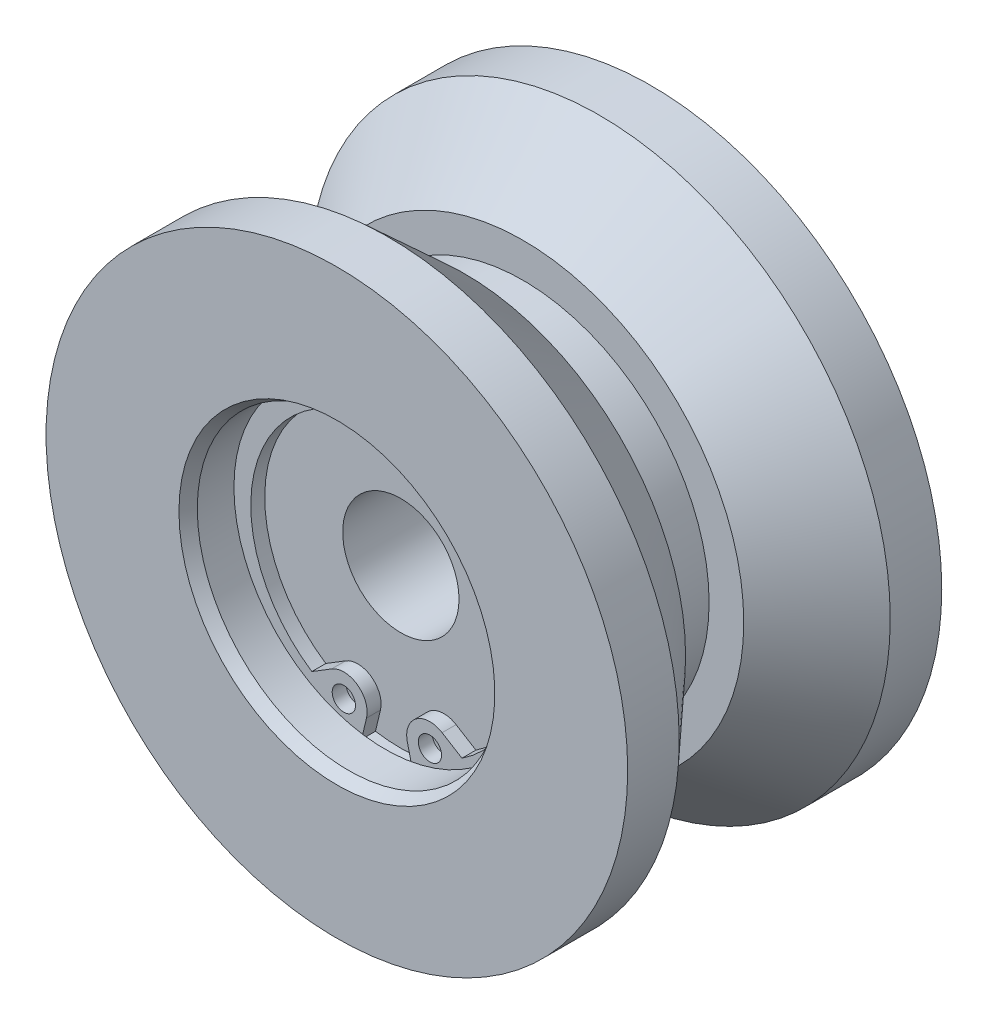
ISO-10303-21;
HEADER;
FILE_DESCRIPTION(('STEP AP214'),'2;1');
FILE_NAME('part.step','',(''),(''),'','','');
FILE_SCHEMA(('AUTOMOTIVE_DESIGN { 1 0 10303 214 1 1 1 1 }'));
ENDSEC;
DATA;
#1=APPLICATION_CONTEXT('core data for automotive mechanical design processes');
#2=APPLICATION_PROTOCOL_DEFINITION('international standard','automotive_design',2000,#1);
#3=PRODUCT_CONTEXT('',#1,'mechanical');
#4=PRODUCT('Part','Part','',(#3));
#5=PRODUCT_RELATED_PRODUCT_CATEGORY('part','',(#4));
#6=PRODUCT_DEFINITION_FORMATION('','',#4);
#7=PRODUCT_DEFINITION_CONTEXT('part definition',#1,'design');
#8=PRODUCT_DEFINITION('design','',#6,#7);
#9=PRODUCT_DEFINITION_SHAPE('','',#8);
#10=(LENGTH_UNIT() NAMED_UNIT(*) SI_UNIT(.MILLI.,.METRE.));
#11=(NAMED_UNIT(*) PLANE_ANGLE_UNIT() SI_UNIT($,.RADIAN.));
#12=(NAMED_UNIT(*) SI_UNIT($,.STERADIAN.) SOLID_ANGLE_UNIT());
#13=UNCERTAINTY_MEASURE_WITH_UNIT(LENGTH_MEASURE(1.E-05),#10,'distance_accuracy_value','');
#14=(GEOMETRIC_REPRESENTATION_CONTEXT(3) GLOBAL_UNCERTAINTY_ASSIGNED_CONTEXT((#13)) GLOBAL_UNIT_ASSIGNED_CONTEXT((#10,
#11,#12)) REPRESENTATION_CONTEXT('',''));
#15=CARTESIAN_POINT('',(0.,0.,0.));
#16=DIRECTION('',(0.,0.,1.));
#17=DIRECTION('',(1.,0.,0.));
#18=AXIS2_PLACEMENT_3D('',#15,#16,#17);
#19=CARTESIAN_POINT('',(0.,13.,7.9999999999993));
#20=DIRECTION('',(0.,0.,-1.));
#21=DIRECTION('',(-1.,0.,0.));
#22=AXIS2_PLACEMENT_3D('',#19,#20,#21);
#23=PLANE('',#22);
#24=CARTESIAN_POINT('',(3.7,-11.165302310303,7.9999999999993));
#25=DIRECTION('',(0.,0.,1.));
#26=DIRECTION('',(1.,0.,0.));
#27=AXIS2_PLACEMENT_3D('',#24,#25,#26);
#28=CIRCLE('',#27,1.);
#29=CARTESIAN_POINT('',(4.7,-11.165302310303,7.9999999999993));
#30=VERTEX_POINT('',#29);
#31=EDGE_CURVE('E117',#30,#30,#28,.T.);
#32=ORIENTED_EDGE('',*,*,#31,.T.);
#33=EDGE_LOOP('',(#32));
#34=FACE_BOUND('',#33,.T.);
#35=ADVANCED_FACE('F14',(#34),#23,.F.);
#36=CARTESIAN_POINT('',(-3.7,-11.165302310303,7.9999999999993));
#37=DIRECTION('',(0.,0.,-1.));
#38=DIRECTION('',(1.,0.,0.));
#39=AXIS2_PLACEMENT_3D('',#36,#37,#38);
#40=CIRCLE('',#39,1.);
#41=CARTESIAN_POINT('',(-2.7,-11.165302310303,7.9999999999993));
#42=VERTEX_POINT('',#41);
#43=EDGE_CURVE('E142',#42,#42,#40,.T.);
#44=ORIENTED_EDGE('',*,*,#43,.F.);
#45=EDGE_LOOP('',(#44));
#46=FACE_BOUND('',#45,.T.);
#47=ADVANCED_FACE('F247',(#46),#23,.F.);
#48=CARTESIAN_POINT('',(0.,0.,18.4999999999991));
#49=DIRECTION('',(0.,0.,1.));
#50=DIRECTION('',(1.,0.,0.));
#51=AXIS2_PLACEMENT_3D('',#48,#49,#50);
#52=CYLINDRICAL_SURFACE('',#51,16.);
#53=CARTESIAN_POINT('',(0.,0.,2.5));
#54=DIRECTION('',(0.,0.,1.));
#55=DIRECTION('',(1.,0.,0.));
#56=AXIS2_PLACEMENT_3D('',#53,#54,#55);
#57=CIRCLE('',#56,16.);
#58=CARTESIAN_POINT('',(16.,0.,2.5));
#59=VERTEX_POINT('',#58);
#60=EDGE_CURVE('E190',#59,#59,#57,.T.);
#61=ORIENTED_EDGE('',*,*,#60,.F.);
#62=EDGE_LOOP('',(#61));
#63=FACE_BOUND('',#62,.T.);
#64=CARTESIAN_POINT('',(0.,0.,-2.5));
#65=DIRECTION('',(0.,0.,1.));
#66=DIRECTION('',(1.,0.,0.));
#67=AXIS2_PLACEMENT_3D('',#64,#65,#66);
#68=CIRCLE('',#67,16.);
#69=CARTESIAN_POINT('',(16.,0.,-2.5));
#70=VERTEX_POINT('',#69);
#71=EDGE_CURVE('E193',#70,#70,#68,.T.);
#72=ORIENTED_EDGE('',*,*,#71,.T.);
#73=EDGE_LOOP('',(#72));
#74=FACE_BOUND('',#73,.T.);
#75=ADVANCED_FACE('F252',(#63,#74),#52,.T.);
#76=CARTESIAN_POINT('',(0.,18.9780763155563,2.5));
#77=DIRECTION('',(0.,0.,1.));
#78=DIRECTION('',(1.,0.,0.));
#79=AXIS2_PLACEMENT_3D('',#76,#77,#78);
#80=PLANE('',#79);
#81=CARTESIAN_POINT('',(0.,0.,2.5));
#82=DIRECTION('',(0.,0.,1.));
#83=DIRECTION('',(1.,0.,0.));
#84=AXIS2_PLACEMENT_3D('',#81,#82,#83);
#85=CIRCLE('',#84,18.9780763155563);
#86=CARTESIAN_POINT('',(18.9780763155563,0.,2.5));
#87=VERTEX_POINT('',#86);
#88=EDGE_CURVE('E187',#87,#87,#85,.T.);
#89=ORIENTED_EDGE('',*,*,#88,.F.);
#90=EDGE_LOOP('',(#89));
#91=FACE_BOUND('',#90,.T.);
#92=ORIENTED_EDGE('',*,*,#60,.T.);
#93=EDGE_LOOP('',(#92));
#94=FACE_BOUND('',#93,.T.);
#95=ADVANCED_FACE('F484',(#91,#94),#80,.F.);
#96=CARTESIAN_POINT('',(0.,18.9780763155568,-2.5));
#97=DIRECTION('',(0.,0.,-1.));
#98=DIRECTION('',(-1.,0.,0.));
#99=AXIS2_PLACEMENT_3D('',#96,#97,#98);
#100=PLANE('',#99);
#101=ORIENTED_EDGE('',*,*,#71,.F.);
#102=EDGE_LOOP('',(#101));
#103=FACE_BOUND('',#102,.T.);
#104=CARTESIAN_POINT('',(0.,0.,-2.5));
#105=DIRECTION('',(0.,0.,1.));
#106=DIRECTION('',(1.,0.,0.));
#107=AXIS2_PLACEMENT_3D('',#104,#105,#106);
#108=CIRCLE('',#107,18.9780763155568);
#109=CARTESIAN_POINT('',(18.9780763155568,0.,-2.5));
#110=VERTEX_POINT('',#109);
#111=EDGE_CURVE('E196',#110,#110,#108,.T.);
#112=ORIENTED_EDGE('',*,*,#111,.T.);
#113=EDGE_LOOP('',(#112));
#114=FACE_BOUND('',#113,.T.);
#115=ADVANCED_FACE('F475',(#103,#114),#100,.F.);
#116=CARTESIAN_POINT('',(0.,0.,2.5));
#117=DIRECTION('',(0.,0.,1.));
#118=DIRECTION('',(1.,0.,0.));
#119=AXIS2_PLACEMENT_3D('',#116,#117,#118);
#120=CONICAL_SURFACE('',#119,18.9780763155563,0.741764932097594);
#121=CARTESIAN_POINT('',(0.,0.,9.07177650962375));
#122=DIRECTION('',(0.,0.,1.));
#123=DIRECTION('',(1.,0.,0.));
#124=AXIS2_PLACEMENT_3D('',#121,#122,#123);
#125=CIRCLE('',#124,25.);
#126=CARTESIAN_POINT('',(25.,0.,9.07177650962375));
#127=VERTEX_POINT('',#126);
#128=EDGE_CURVE('E184',#127,#127,#125,.T.);
#129=ORIENTED_EDGE('',*,*,#128,.F.);
#130=EDGE_LOOP('',(#129));
#131=FACE_BOUND('',#130,.T.);
#132=ORIENTED_EDGE('',*,*,#88,.T.);
#133=EDGE_LOOP('',(#132));
#134=FACE_BOUND('',#133,.T.);
#135=ADVANCED_FACE('F466',(#131,#134),#120,.T.);
#136=CARTESIAN_POINT('',(0.,0.,-9.07177650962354));
#137=DIRECTION('',(0.,0.,-1.));
#138=DIRECTION('',(-1.,0.,0.));
#139=AXIS2_PLACEMENT_3D('',#136,#137,#138);
#140=CONICAL_SURFACE('',#139,25.,0.741764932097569);
#141=ORIENTED_EDGE('',*,*,#111,.F.);
#142=EDGE_LOOP('',(#141));
#143=FACE_BOUND('',#142,.T.);
#144=CARTESIAN_POINT('',(0.,0.,-9.07177650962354));
#145=DIRECTION('',(0.,0.,1.));
#146=DIRECTION('',(1.,0.,0.));
#147=AXIS2_PLACEMENT_3D('',#144,#145,#146);
#148=CIRCLE('',#147,25.);
#149=CARTESIAN_POINT('',(25.,0.,-9.07177650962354));
#150=VERTEX_POINT('',#149);
#151=EDGE_CURVE('E199',#150,#150,#148,.T.);
#152=ORIENTED_EDGE('',*,*,#151,.T.);
#153=EDGE_LOOP('',(#152));
#154=FACE_BOUND('',#153,.T.);
#155=ADVANCED_FACE('F457',(#143,#154),#140,.T.);
#156=CARTESIAN_POINT('',(0.,0.,18.4999999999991));
#157=DIRECTION('',(0.,0.,1.));
#158=DIRECTION('',(1.,0.,0.));
#159=AXIS2_PLACEMENT_3D('',#156,#157,#158);
#160=CYLINDRICAL_SURFACE('',#159,25.);
#161=CARTESIAN_POINT('',(0.,0.,13.4999999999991));
#162=DIRECTION('',(0.,0.,1.));
#163=DIRECTION('',(1.,0.,0.));
#164=AXIS2_PLACEMENT_3D('',#161,#162,#163);
#165=CIRCLE('',#164,25.);
#166=CARTESIAN_POINT('',(25.,0.,13.4999999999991));
#167=VERTEX_POINT('',#166);
#168=EDGE_CURVE('E181',#167,#167,#165,.T.);
#169=ORIENTED_EDGE('',*,*,#168,.F.);
#170=EDGE_LOOP('',(#169));
#171=FACE_BOUND('',#170,.T.);
#172=ORIENTED_EDGE('',*,*,#128,.T.);
#173=EDGE_LOOP('',(#172));
#174=FACE_BOUND('',#173,.T.);
#175=ADVANCED_FACE('F448',(#171,#174),#160,.T.);
#176=CARTESIAN_POINT('',(0.,0.,18.4999999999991));
#177=DIRECTION('',(0.,0.,1.));
#178=DIRECTION('',(1.,0.,0.));
#179=AXIS2_PLACEMENT_3D('',#176,#177,#178);
#180=CYLINDRICAL_SURFACE('',#179,25.);
#181=ORIENTED_EDGE('',*,*,#151,.F.);
#182=EDGE_LOOP('',(#181));
#183=FACE_BOUND('',#182,.T.);
#184=CARTESIAN_POINT('',(0.,0.,-13.5));
#185=DIRECTION('',(0.,0.,1.));
#186=DIRECTION('',(1.,0.,0.));
#187=AXIS2_PLACEMENT_3D('',#184,#185,#186);
#188=CIRCLE('',#187,25.);
#189=CARTESIAN_POINT('',(25.,0.,-13.5));
#190=VERTEX_POINT('',#189);
#191=EDGE_CURVE('E202',#190,#190,#188,.T.);
#192=ORIENTED_EDGE('',*,*,#191,.T.);
#193=EDGE_LOOP('',(#192));
#194=FACE_BOUND('',#193,.T.);
#195=ADVANCED_FACE('F439',(#183,#194),#180,.T.);
#196=CARTESIAN_POINT('',(0.,13.,13.4999999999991));
#197=DIRECTION('',(0.,0.,-1.));
#198=DIRECTION('',(-1.,0.,0.));
#199=AXIS2_PLACEMENT_3D('',#196,#197,#198);
#200=PLANE('',#199);
#201=CARTESIAN_POINT('',(0.,0.,13.4999999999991));
#202=DIRECTION('',(0.,0.,-1.));
#203=DIRECTION('',(-1.,0.,0.));
#204=AXIS2_PLACEMENT_3D('',#201,#202,#203);
#205=CIRCLE('',#204,13.5773502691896);
#206=CARTESIAN_POINT('',(-13.5773502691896,0.,13.4999999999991));
#207=VERTEX_POINT('',#206);
#208=EDGE_CURVE('E143',#207,#207,#205,.T.);
#209=ORIENTED_EDGE('',*,*,#208,.T.);
#210=EDGE_LOOP('',(#209));
#211=FACE_BOUND('',#210,.T.);
#212=ORIENTED_EDGE('',*,*,#168,.T.);
#213=EDGE_LOOP('',(#212));
#214=FACE_BOUND('',#213,.T.);
#215=ADVANCED_FACE('F430',(#211,#214),#200,.F.);
#216=CARTESIAN_POINT('',(0.,11.,-13.5));
#217=DIRECTION('',(0.,0.,1.));
#218=DIRECTION('',(1.,0.,0.));
#219=AXIS2_PLACEMENT_3D('',#216,#217,#218);
#220=PLANE('',#219);
#221=ORIENTED_EDGE('',*,*,#191,.F.);
#222=EDGE_LOOP('',(#221));
#223=FACE_BOUND('',#222,.T.);
#224=CARTESIAN_POINT('',(0.,0.,-13.5));
#225=DIRECTION('',(0.,0.,1.));
#226=DIRECTION('',(1.,0.,0.));
#227=AXIS2_PLACEMENT_3D('',#224,#225,#226);
#228=CIRCLE('',#227,11.);
#229=CARTESIAN_POINT('',(11.,0.,-13.5));
#230=VERTEX_POINT('',#229);
#231=EDGE_CURVE('E205',#230,#230,#228,.T.);
#232=ORIENTED_EDGE('',*,*,#231,.T.);
#233=EDGE_LOOP('',(#232));
#234=FACE_BOUND('',#233,.T.);
#235=ADVANCED_FACE('F422',(#223,#234),#220,.F.);
#236=CARTESIAN_POINT('',(0.,0.,12.4999999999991));
#237=DIRECTION('',(0.,0.,1.));
#238=DIRECTION('',(1.,0.,0.));
#239=AXIS2_PLACEMENT_3D('',#236,#237,#238);
#240=CONICAL_SURFACE('',#239,13.,0.523598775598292);
#241=ORIENTED_EDGE('',*,*,#208,.F.);
#242=EDGE_LOOP('',(#241));
#243=FACE_BOUND('',#242,.T.);
#244=CARTESIAN_POINT('',(0.,0.,12.4999999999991));
#245=DIRECTION('',(0.,0.,-1.));
#246=DIRECTION('',(-1.,0.,0.));
#247=AXIS2_PLACEMENT_3D('',#244,#245,#246);
#248=CIRCLE('',#247,13.);
#249=CARTESIAN_POINT('',(-13.,0.,12.4999999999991));
#250=VERTEX_POINT('',#249);
#251=EDGE_CURVE('E217',#250,#250,#248,.F.);
#252=ORIENTED_EDGE('',*,*,#251,.F.);
#253=EDGE_LOOP('',(#252));
#254=FACE_BOUND('',#253,.T.);
#255=ADVANCED_FACE('F16',(#243,#254),#240,.F.);
#256=CARTESIAN_POINT('',(0.,0.,18.4999999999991));
#257=DIRECTION('',(0.,0.,1.));
#258=DIRECTION('',(1.,0.,0.));
#259=AXIS2_PLACEMENT_3D('',#256,#257,#258);
#260=CYLINDRICAL_SURFACE('',#259,11.);
#261=ORIENTED_EDGE('',*,*,#231,.F.);
#262=EDGE_LOOP('',(#261));
#263=FACE_BOUND('',#262,.T.);
#264=CARTESIAN_POINT('',(0.,0.,-7.9999999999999));
#265=DIRECTION('',(0.,0.,1.));
#266=DIRECTION('',(1.,0.,0.));
#267=AXIS2_PLACEMENT_3D('',#264,#265,#266);
#268=CIRCLE('',#267,11.);
#269=CARTESIAN_POINT('',(11.,0.,-7.9999999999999));
#270=VERTEX_POINT('',#269);
#271=EDGE_CURVE('E208',#270,#270,#268,.T.);
#272=ORIENTED_EDGE('',*,*,#271,.T.);
#273=EDGE_LOOP('',(#272));
#274=FACE_BOUND('',#273,.T.);
#275=ADVANCED_FACE('F405',(#263,#274),#260,.F.);
#276=CARTESIAN_POINT('',(0.,0.,18.4999999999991));
#277=DIRECTION('',(0.,0.,1.));
#278=DIRECTION('',(1.,0.,0.));
#279=AXIS2_PLACEMENT_3D('',#276,#277,#278);
#280=CYLINDRICAL_SURFACE('',#279,13.);
#281=CARTESIAN_POINT('',(0.,0.,9.3499999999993));
#282=DIRECTION('',(0.,0.,1.));
#283=DIRECTION('',(1.,0.,0.));
#284=AXIS2_PLACEMENT_3D('',#281,#282,#283);
#285=CIRCLE('',#284,13.);
#286=CARTESIAN_POINT('',(13.,0.,9.3499999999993));
#287=VERTEX_POINT('',#286);
#288=EDGE_CURVE('E178',#287,#287,#285,.F.);
#289=ORIENTED_EDGE('',*,*,#288,.T.);
#290=EDGE_LOOP('',(#289));
#291=FACE_BOUND('',#290,.T.);
#292=ORIENTED_EDGE('',*,*,#251,.T.);
#293=EDGE_LOOP('',(#292));
#294=FACE_BOUND('',#293,.T.);
#295=ADVANCED_FACE('F225',(#291,#294),#280,.F.);
#296=CARTESIAN_POINT('',(0.,11.,-7.99999999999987));
#297=DIRECTION('',(0.,0.,1.));
#298=DIRECTION('',(1.,0.,0.));
#299=AXIS2_PLACEMENT_3D('',#296,#297,#298);
#300=PLANE('',#299);
#301=ORIENTED_EDGE('',*,*,#271,.F.);
#302=EDGE_LOOP('',(#301));
#303=FACE_BOUND('',#302,.T.);
#304=CARTESIAN_POINT('',(0.,0.,-7.99999999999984));
#305=DIRECTION('',(0.,0.,1.));
#306=DIRECTION('',(1.,0.,0.));
#307=AXIS2_PLACEMENT_3D('',#304,#305,#306);
#308=CIRCLE('',#307,5.00000000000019);
#309=CARTESIAN_POINT('',(5.00000000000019,0.,-7.99999999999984));
#310=VERTEX_POINT('',#309);
#311=EDGE_CURVE('E211',#310,#310,#308,.T.);
#312=ORIENTED_EDGE('',*,*,#311,.T.);
#313=EDGE_LOOP('',(#312));
#314=FACE_BOUND('',#313,.T.);
#315=ADVANCED_FACE('F231',(#303,#314),#300,.F.);
#316=CARTESIAN_POINT('',(0.,0.,9.3499999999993));
#317=DIRECTION('',(0.,0.,1.));
#318=DIRECTION('',(1.,0.,0.));
#319=AXIS2_PLACEMENT_3D('',#316,#317,#318);
#320=PLANE('',#319);
#321=CARTESIAN_POINT('',(0.,0.,9.3499999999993));
#322=DIRECTION('',(0.,0.,1.));
#323=DIRECTION('',(1.,0.,0.));
#324=AXIS2_PLACEMENT_3D('',#321,#322,#323);
#325=CIRCLE('',#324,13.6);
#326=CARTESIAN_POINT('',(13.6,0.,9.3499999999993));
#327=VERTEX_POINT('',#326);
#328=EDGE_CURVE('E175',#327,#327,#325,.T.);
#329=ORIENTED_EDGE('',*,*,#328,.F.);
#330=EDGE_LOOP('',(#329));
#331=FACE_BOUND('',#330,.T.);
#332=ORIENTED_EDGE('',*,*,#288,.F.);
#333=EDGE_LOOP('',(#332));
#334=FACE_BOUND('',#333,.T.);
#335=ADVANCED_FACE('F228',(#331,#334),#320,.F.);
#336=CARTESIAN_POINT('',(0.,0.,9.3499999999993));
#337=DIRECTION('',(0.,0.,-1.));
#338=DIRECTION('',(-1.,0.,0.));
#339=AXIS2_PLACEMENT_3D('',#336,#337,#338);
#340=CYLINDRICAL_SURFACE('',#339,13.6);
#341=ORIENTED_EDGE('',*,*,#328,.T.);
#342=EDGE_LOOP('',(#341));
#343=FACE_BOUND('',#342,.T.);
#344=DIRECTION('',(0.,0.,-1.));
#345=VECTOR('',#344,1.);
#346=CARTESIAN_POINT('',(2.18133072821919,-13.4239262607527,9.3499999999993));
#347=LINE('',#346,#345);
#348=CARTESIAN_POINT('',(2.18133072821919,-13.4239262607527,7.9999999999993));
#349=VERTEX_POINT('',#348);
#350=CARTESIAN_POINT('',(2.18133072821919,-13.4239262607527,9.1999999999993));
#351=VERTEX_POINT('',#350);
#352=EDGE_CURVE('E18',#349,#351,#347,.F.);
#353=ORIENTED_EDGE('',*,*,#352,.F.);
#354=CARTESIAN_POINT('',(0.,0.,7.9999999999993));
#355=DIRECTION('',(0.,0.,1.));
#356=DIRECTION('',(1.,0.,0.));
#357=AXIS2_PLACEMENT_3D('',#354,#355,#356);
#358=CIRCLE('',#357,13.6);
#359=CARTESIAN_POINT('',(-2.18133072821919,-13.4239262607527,7.9999999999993));
#360=VERTEX_POINT('',#359);
#361=EDGE_CURVE('E179',#360,#349,#358,.T.);
#362=ORIENTED_EDGE('',*,*,#361,.F.);
#363=DIRECTION('',(0.,0.,-1.));
#364=VECTOR('',#363,1.);
#365=CARTESIAN_POINT('',(-2.18133072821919,-13.4239262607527,9.3499999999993));
#366=LINE('',#365,#364);
#367=CARTESIAN_POINT('',(-2.18133072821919,-13.4239262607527,9.1999999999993));
#368=VERTEX_POINT('',#367);
#369=EDGE_CURVE('E105',#368,#360,#366,.T.);
#370=ORIENTED_EDGE('',*,*,#369,.F.);
#371=CARTESIAN_POINT('',(0.,0.,9.1999999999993));
#372=DIRECTION('',(0.,0.,-1.));
#373=DIRECTION('',(-1.,0.,0.));
#374=AXIS2_PLACEMENT_3D('',#371,#372,#373);
#375=CIRCLE('',#374,13.6);
#376=EDGE_CURVE('E9',#351,#368,#375,.F.);
#377=ORIENTED_EDGE('',*,*,#376,.F.);
#378=EDGE_LOOP('',(#353,#362,#370,#377));
#379=FACE_BOUND('',#378,.T.);
#380=ADVANCED_FACE('F230',(#343,#379),#340,.F.);
#381=CARTESIAN_POINT('',(0.,0.,18.4999999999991));
#382=DIRECTION('',(0.,0.,1.));
#383=DIRECTION('',(1.,0.,0.));
#384=AXIS2_PLACEMENT_3D('',#381,#382,#383);
#385=CYLINDRICAL_SURFACE('',#384,5.00000000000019);
#386=ORIENTED_EDGE('',*,*,#311,.F.);
#387=EDGE_LOOP('',(#386));
#388=FACE_BOUND('',#387,.T.);
#389=CARTESIAN_POINT('',(0.,0.,7.9999999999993));
#390=DIRECTION('',(0.,0.,1.));
#391=DIRECTION('',(1.,0.,0.));
#392=AXIS2_PLACEMENT_3D('',#389,#390,#391);
#393=CIRCLE('',#392,5.00000000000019);
#394=CARTESIAN_POINT('',(5.00000000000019,0.,7.9999999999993));
#395=VERTEX_POINT('',#394);
#396=EDGE_CURVE('E214',#395,#395,#393,.T.);
#397=ORIENTED_EDGE('',*,*,#396,.T.);
#398=EDGE_LOOP('',(#397));
#399=FACE_BOUND('',#398,.T.);
#400=ADVANCED_FACE('F239',(#388,#399),#385,.F.);
#401=ORIENTED_EDGE('',*,*,#396,.F.);
#402=EDGE_LOOP('',(#401));
#403=FACE_BOUND('',#402,.T.);
#404=ORIENTED_EDGE('',*,*,#361,.T.);
#405=DIRECTION('',(0.231349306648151,-0.972870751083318,0.));
#406=VECTOR('',#405,1.);
#407=CARTESIAN_POINT('',(1.75425849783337,-11.6280009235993,7.9999999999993));
#408=LINE('',#407,#406);
#409=CARTESIAN_POINT('',(1.75425849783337,-11.6280009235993,7.9999999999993));
#410=VERTEX_POINT('',#409);
#411=EDGE_CURVE('E34',#410,#349,#408,.T.);
#412=ORIENTED_EDGE('',*,*,#411,.F.);
#413=CARTESIAN_POINT('',(3.7,-11.165302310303,7.9999999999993));
#414=DIRECTION('',(0.,0.,1.));
#415=DIRECTION('',(1.,0.,0.));
#416=AXIS2_PLACEMENT_3D('',#413,#414,#415);
#417=CIRCLE('',#416,2.);
#418=CARTESIAN_POINT('',(4.74866968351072,-9.46227797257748,7.9999999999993));
#419=VERTEX_POINT('',#418);
#420=EDGE_CURVE('E137',#419,#410,#417,.T.);
#421=ORIENTED_EDGE('',*,*,#420,.F.);
#422=DIRECTION('',(-0.851512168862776,0.524334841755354,0.));
#423=VECTOR('',#422,1.);
#424=CARTESIAN_POINT('',(4.74866968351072,-9.46227797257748,7.9999999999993));
#425=LINE('',#424,#423);
#426=CARTESIAN_POINT('',(6.45127454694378,-10.5106893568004,7.9999999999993));
#427=VERTEX_POINT('',#426);
#428=EDGE_CURVE('E112',#427,#419,#425,.T.);
#429=ORIENTED_EDGE('',*,*,#428,.F.);
#430=CARTESIAN_POINT('',(0.,-0.75,7.9999999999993));
#431=DIRECTION('',(0.,0.,-1.));
#432=DIRECTION('',(0.,-1.,0.));
#433=AXIS2_PLACEMENT_3D('',#430,#431,#432);
#434=CIRCLE('',#433,11.7);
#435=CARTESIAN_POINT('',(-6.45127454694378,-10.5106893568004,7.9999999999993));
#436=VERTEX_POINT('',#435);
#437=EDGE_CURVE('E108',#436,#427,#434,.T.);
#438=ORIENTED_EDGE('',*,*,#437,.F.);
#439=DIRECTION('',(-0.851512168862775,-0.524334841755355,0.));
#440=VECTOR('',#439,1.);
#441=CARTESIAN_POINT('',(-4.74866968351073,-9.46227797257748,7.9999999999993));
#442=LINE('',#441,#440);
#443=CARTESIAN_POINT('',(-4.74866968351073,-9.46227797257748,7.9999999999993));
#444=VERTEX_POINT('',#443);
#445=EDGE_CURVE('E94',#444,#436,#442,.T.);
#446=ORIENTED_EDGE('',*,*,#445,.F.);
#447=CARTESIAN_POINT('',(-3.7,-11.165302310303,7.9999999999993));
#448=DIRECTION('',(0.,0.,1.));
#449=DIRECTION('',(-1.,0.,0.));
#450=AXIS2_PLACEMENT_3D('',#447,#448,#449);
#451=CIRCLE('',#450,2.);
#452=CARTESIAN_POINT('',(-1.75425849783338,-11.6280009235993,7.9999999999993));
#453=VERTEX_POINT('',#452);
#454=EDGE_CURVE('E148',#453,#444,#451,.T.);
#455=ORIENTED_EDGE('',*,*,#454,.F.);
#456=DIRECTION('',(0.231349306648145,0.97287075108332,0.));
#457=VECTOR('',#456,1.);
#458=CARTESIAN_POINT('',(-1.75425849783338,-11.6280009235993,7.9999999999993));
#459=LINE('',#458,#457);
#460=EDGE_CURVE('E144',#360,#453,#459,.T.);
#461=ORIENTED_EDGE('',*,*,#460,.F.);
#462=EDGE_LOOP('',(#404,#412,#421,#429,#438,#446,#455,#461));
#463=FACE_BOUND('',#462,.T.);
#464=ADVANCED_FACE('F110',(#403,#463),#23,.F.);
#465=CARTESIAN_POINT('',(0.,-0.75,9.1999999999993));
#466=DIRECTION('',(0.,0.,1.));
#467=DIRECTION('',(-1.,0.,0.));
#468=AXIS2_PLACEMENT_3D('',#465,#466,#467);
#469=CYLINDRICAL_SURFACE('',#468,11.7);
#470=ORIENTED_EDGE('',*,*,#437,.T.);
#471=DIRECTION('',(0.,0.,-1.));
#472=VECTOR('',#471,1.);
#473=CARTESIAN_POINT('',(6.45127454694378,-10.5106893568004,9.1999999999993));
#474=LINE('',#473,#472);
#475=CARTESIAN_POINT('',(6.45127454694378,-10.5106893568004,9.1999999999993));
#476=VERTEX_POINT('',#475);
#477=EDGE_CURVE('E127',#476,#427,#474,.T.);
#478=ORIENTED_EDGE('',*,*,#477,.F.);
#479=CARTESIAN_POINT('',(0.,-0.75,9.1999999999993));
#480=DIRECTION('',(0.,0.,-1.));
#481=DIRECTION('',(0.,-1.,0.));
#482=AXIS2_PLACEMENT_3D('',#479,#480,#481);
#483=CIRCLE('',#482,11.7);
#484=CARTESIAN_POINT('',(-6.45127454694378,-10.5106893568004,9.1999999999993));
#485=VERTEX_POINT('',#484);
#486=EDGE_CURVE('E120',#485,#476,#483,.T.);
#487=ORIENTED_EDGE('',*,*,#486,.F.);
#488=DIRECTION('',(0.,0.,-1.));
#489=VECTOR('',#488,1.);
#490=CARTESIAN_POINT('',(-6.45127454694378,-10.5106893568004,9.1999999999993));
#491=LINE('',#490,#489);
#492=EDGE_CURVE('E98',#485,#436,#491,.T.);
#493=ORIENTED_EDGE('',*,*,#492,.T.);
#494=EDGE_LOOP('',(#470,#478,#487,#493));
#495=FACE_BOUND('',#494,.T.);
#496=ADVANCED_FACE('F119',(#495),#469,.F.);
#497=CARTESIAN_POINT('',(4.74866968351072,-9.46227797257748,9.1999999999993));
#498=DIRECTION('',(-0.524334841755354,-0.851512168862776,0.));
#499=DIRECTION('',(-0.851512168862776,0.524334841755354,0.));
#500=AXIS2_PLACEMENT_3D('',#497,#498,#499);
#501=PLANE('',#500);
#502=ORIENTED_EDGE('',*,*,#428,.T.);
#503=DIRECTION('',(0.,0.,-1.));
#504=VECTOR('',#503,1.);
#505=CARTESIAN_POINT('',(4.74866968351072,-9.46227797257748,9.1999999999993));
#506=LINE('',#505,#504);
#507=CARTESIAN_POINT('',(4.74866968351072,-9.46227797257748,9.1999999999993));
#508=VERTEX_POINT('',#507);
#509=EDGE_CURVE('E155',#508,#419,#506,.T.);
#510=ORIENTED_EDGE('',*,*,#509,.F.);
#511=DIRECTION('',(-0.851512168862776,0.524334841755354,0.));
#512=VECTOR('',#511,1.);
#513=CARTESIAN_POINT('',(4.74866968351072,-9.46227797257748,9.1999999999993));
#514=LINE('',#513,#512);
#515=EDGE_CURVE('E131',#476,#508,#514,.T.);
#516=ORIENTED_EDGE('',*,*,#515,.F.);
#517=ORIENTED_EDGE('',*,*,#477,.T.);
#518=EDGE_LOOP('',(#502,#510,#516,#517));
#519=FACE_BOUND('',#518,.T.);
#520=ADVANCED_FACE('F259',(#519),#501,.F.);
#521=CARTESIAN_POINT('',(3.7,-11.165302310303,9.1999999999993));
#522=DIRECTION('',(0.,0.,1.));
#523=DIRECTION('',(-1.,0.,0.));
#524=AXIS2_PLACEMENT_3D('',#521,#522,#523);
#525=CYLINDRICAL_SURFACE('',#524,2.);
#526=ORIENTED_EDGE('',*,*,#420,.T.);
#527=DIRECTION('',(0.,0.,-1.));
#528=VECTOR('',#527,1.);
#529=CARTESIAN_POINT('',(1.75425849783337,-11.6280009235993,9.1999999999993));
#530=LINE('',#529,#528);
#531=CARTESIAN_POINT('',(1.75425849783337,-11.6280009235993,9.1999999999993));
#532=VERTEX_POINT('',#531);
#533=EDGE_CURVE('E147',#532,#410,#530,.T.);
#534=ORIENTED_EDGE('',*,*,#533,.F.);
#535=CARTESIAN_POINT('',(3.7,-11.165302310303,9.1999999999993));
#536=DIRECTION('',(0.,0.,1.));
#537=DIRECTION('',(1.,0.,0.));
#538=AXIS2_PLACEMENT_3D('',#535,#536,#537);
#539=CIRCLE('',#538,2.);
#540=EDGE_CURVE('E165',#508,#532,#539,.T.);
#541=ORIENTED_EDGE('',*,*,#540,.F.);
#542=ORIENTED_EDGE('',*,*,#509,.T.);
#543=EDGE_LOOP('',(#526,#534,#541,#542));
#544=FACE_BOUND('',#543,.T.);
#545=ADVANCED_FACE('F263',(#544),#525,.T.);
#546=CARTESIAN_POINT('',(-1.75425849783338,-11.6280009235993,9.1999999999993));
#547=DIRECTION('',(-0.97287075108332,0.231349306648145,0.));
#548=DIRECTION('',(0.,0.,1.));
#549=AXIS2_PLACEMENT_3D('',#546,#547,#548);
#550=PLANE('',#549);
#551=DIRECTION('',(0.231349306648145,0.97287075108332,0.));
#552=VECTOR('',#551,1.);
#553=CARTESIAN_POINT('',(-1.75425849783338,-11.6280009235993,9.1999999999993));
#554=LINE('',#553,#552);
#555=CARTESIAN_POINT('',(-1.75425849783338,-11.6280009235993,9.1999999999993));
#556=VERTEX_POINT('',#555);
#557=EDGE_CURVE('E149',#368,#556,#554,.T.);
#558=ORIENTED_EDGE('',*,*,#557,.F.);
#559=ORIENTED_EDGE('',*,*,#369,.T.);
#560=ORIENTED_EDGE('',*,*,#460,.T.);
#561=DIRECTION('',(0.,0.,-1.));
#562=VECTOR('',#561,1.);
#563=CARTESIAN_POINT('',(-1.75425849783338,-11.6280009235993,9.1999999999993));
#564=LINE('',#563,#562);
#565=EDGE_CURVE('E158',#556,#453,#564,.T.);
#566=ORIENTED_EDGE('',*,*,#565,.F.);
#567=EDGE_LOOP('',(#558,#559,#560,#566));
#568=FACE_BOUND('',#567,.T.);
#569=ADVANCED_FACE('F271',(#568),#550,.F.);
#570=CARTESIAN_POINT('',(0.,-0.75,9.1999999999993));
#571=DIRECTION('',(0.,0.,-1.));
#572=DIRECTION('',(0.,-1.,0.));
#573=AXIS2_PLACEMENT_3D('',#570,#571,#572);
#574=PLANE('',#573);
#575=CARTESIAN_POINT('',(-3.7,-11.165302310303,9.1999999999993));
#576=DIRECTION('',(0.,0.,-1.));
#577=DIRECTION('',(1.,0.,0.));
#578=AXIS2_PLACEMENT_3D('',#575,#576,#577);
#579=CIRCLE('',#578,1.);
#580=CARTESIAN_POINT('',(-2.7,-11.165302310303,9.1999999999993));
#581=VERTEX_POINT('',#580);
#582=EDGE_CURVE('E133',#581,#581,#579,.T.);
#583=ORIENTED_EDGE('',*,*,#582,.T.);
#584=EDGE_LOOP('',(#583));
#585=FACE_BOUND('',#584,.T.);
#586=CARTESIAN_POINT('',(3.7,-11.165302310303,9.1999999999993));
#587=DIRECTION('',(0.,0.,1.));
#588=DIRECTION('',(1.,0.,0.));
#589=AXIS2_PLACEMENT_3D('',#586,#587,#588);
#590=CIRCLE('',#589,1.);
#591=CARTESIAN_POINT('',(4.7,-11.165302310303,9.1999999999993));
#592=VERTEX_POINT('',#591);
#593=EDGE_CURVE('E138',#592,#592,#590,.T.);
#594=ORIENTED_EDGE('',*,*,#593,.F.);
#595=EDGE_LOOP('',(#594));
#596=FACE_BOUND('',#595,.T.);
#597=DIRECTION('',(0.231349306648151,-0.972870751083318,0.));
#598=VECTOR('',#597,1.);
#599=CARTESIAN_POINT('',(1.75425849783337,-11.6280009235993,9.1999999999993));
#600=LINE('',#599,#598);
#601=EDGE_CURVE('E152',#532,#351,#600,.T.);
#602=ORIENTED_EDGE('',*,*,#601,.T.);
#603=ORIENTED_EDGE('',*,*,#376,.T.);
#604=ORIENTED_EDGE('',*,*,#557,.T.);
#605=CARTESIAN_POINT('',(-3.7,-11.165302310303,9.1999999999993));
#606=DIRECTION('',(0.,0.,1.));
#607=DIRECTION('',(-1.,0.,0.));
#608=AXIS2_PLACEMENT_3D('',#605,#606,#607);
#609=CIRCLE('',#608,2.);
#610=CARTESIAN_POINT('',(-4.74866968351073,-9.46227797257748,9.1999999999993));
#611=VERTEX_POINT('',#610);
#612=EDGE_CURVE('E136',#556,#611,#609,.T.);
#613=ORIENTED_EDGE('',*,*,#612,.T.);
#614=DIRECTION('',(-0.851512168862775,-0.524334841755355,0.));
#615=VECTOR('',#614,1.);
#616=CARTESIAN_POINT('',(-4.74866968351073,-9.46227797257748,9.1999999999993));
#617=LINE('',#616,#615);
#618=EDGE_CURVE('E314',#611,#485,#617,.T.);
#619=ORIENTED_EDGE('',*,*,#618,.T.);
#620=ORIENTED_EDGE('',*,*,#486,.T.);
#621=ORIENTED_EDGE('',*,*,#515,.T.);
#622=ORIENTED_EDGE('',*,*,#540,.T.);
#623=EDGE_LOOP('',(#602,#603,#604,#613,#619,#620,#621,#622));
#624=FACE_BOUND('',#623,.T.);
#625=ADVANCED_FACE('F267',(#585,#596,#624),#574,.F.);
#626=CARTESIAN_POINT('',(3.7,-11.165302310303,9.1999999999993));
#627=DIRECTION('',(0.,0.,1.));
#628=DIRECTION('',(-1.,0.,0.));
#629=AXIS2_PLACEMENT_3D('',#626,#627,#628);
#630=CYLINDRICAL_SURFACE('',#629,1.);
#631=ORIENTED_EDGE('',*,*,#31,.F.);
#632=EDGE_LOOP('',(#631));
#633=FACE_BOUND('',#632,.T.);
#634=ORIENTED_EDGE('',*,*,#593,.T.);
#635=EDGE_LOOP('',(#634));
#636=FACE_BOUND('',#635,.T.);
#637=ADVANCED_FACE('F270',(#633,#636),#630,.F.);
#638=CARTESIAN_POINT('',(-3.7,-11.165302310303,9.1999999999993));
#639=DIRECTION('',(0.,0.,1.));
#640=DIRECTION('',(-1.,0.,0.));
#641=AXIS2_PLACEMENT_3D('',#638,#639,#640);
#642=CYLINDRICAL_SURFACE('',#641,1.);
#643=ORIENTED_EDGE('',*,*,#43,.T.);
#644=EDGE_LOOP('',(#643));
#645=FACE_BOUND('',#644,.T.);
#646=ORIENTED_EDGE('',*,*,#582,.F.);
#647=EDGE_LOOP('',(#646));
#648=FACE_BOUND('',#647,.T.);
#649=ADVANCED_FACE('F275',(#645,#648),#642,.F.);
#650=CARTESIAN_POINT('',(-4.74866968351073,-9.46227797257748,9.1999999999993));
#651=DIRECTION('',(0.524334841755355,-0.851512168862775,0.));
#652=DIRECTION('',(0.,0.,-1.));
#653=AXIS2_PLACEMENT_3D('',#650,#651,#652);
#654=PLANE('',#653);
#655=ORIENTED_EDGE('',*,*,#445,.T.);
#656=ORIENTED_EDGE('',*,*,#492,.F.);
#657=ORIENTED_EDGE('',*,*,#618,.F.);
#658=DIRECTION('',(0.,0.,-1.));
#659=VECTOR('',#658,1.);
#660=CARTESIAN_POINT('',(-4.74866968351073,-9.46227797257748,9.1999999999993));
#661=LINE('',#660,#659);
#662=EDGE_CURVE('E101',#611,#444,#661,.T.);
#663=ORIENTED_EDGE('',*,*,#662,.T.);
#664=EDGE_LOOP('',(#655,#656,#657,#663));
#665=FACE_BOUND('',#664,.T.);
#666=ADVANCED_FACE('F96',(#665),#654,.F.);
#667=CARTESIAN_POINT('',(-3.7,-11.165302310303,9.1999999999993));
#668=DIRECTION('',(0.,0.,1.));
#669=DIRECTION('',(-1.,0.,0.));
#670=AXIS2_PLACEMENT_3D('',#667,#668,#669);
#671=CYLINDRICAL_SURFACE('',#670,2.);
#672=ORIENTED_EDGE('',*,*,#454,.T.);
#673=ORIENTED_EDGE('',*,*,#662,.F.);
#674=ORIENTED_EDGE('',*,*,#612,.F.);
#675=ORIENTED_EDGE('',*,*,#565,.T.);
#676=EDGE_LOOP('',(#672,#673,#674,#675));
#677=FACE_BOUND('',#676,.T.);
#678=ADVANCED_FACE('F274',(#677),#671,.T.);
#679=CARTESIAN_POINT('',(1.75425849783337,-11.6280009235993,9.1999999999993));
#680=DIRECTION('',(0.972870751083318,0.231349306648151,0.));
#681=DIRECTION('',(0.,0.,-1.));
#682=AXIS2_PLACEMENT_3D('',#679,#680,#681);
#683=PLANE('',#682);
#684=ORIENTED_EDGE('',*,*,#411,.T.);
#685=ORIENTED_EDGE('',*,*,#352,.T.);
#686=ORIENTED_EDGE('',*,*,#601,.F.);
#687=ORIENTED_EDGE('',*,*,#533,.T.);
#688=EDGE_LOOP('',(#684,#685,#686,#687));
#689=FACE_BOUND('',#688,.T.);
#690=ADVANCED_FACE('F254',(#689),#683,.F.);
#691=CLOSED_SHELL('',(#35,#47,#75,#95,#115,#135,#155,#175,#195,#215,#235,#255,#275,#295,#315,
#335,#380,#400,#464,#496,#520,#545,#569,#625,#637,#649,#666,#678,#690));
#692=MANIFOLD_SOLID_BREP('B1',#691);
#693=ADVANCED_BREP_SHAPE_REPRESENTATION('',(#18,#692),#14);
#694=SHAPE_DEFINITION_REPRESENTATION(#9,#693);
ENDSEC;
END-ISO-10303-21;
